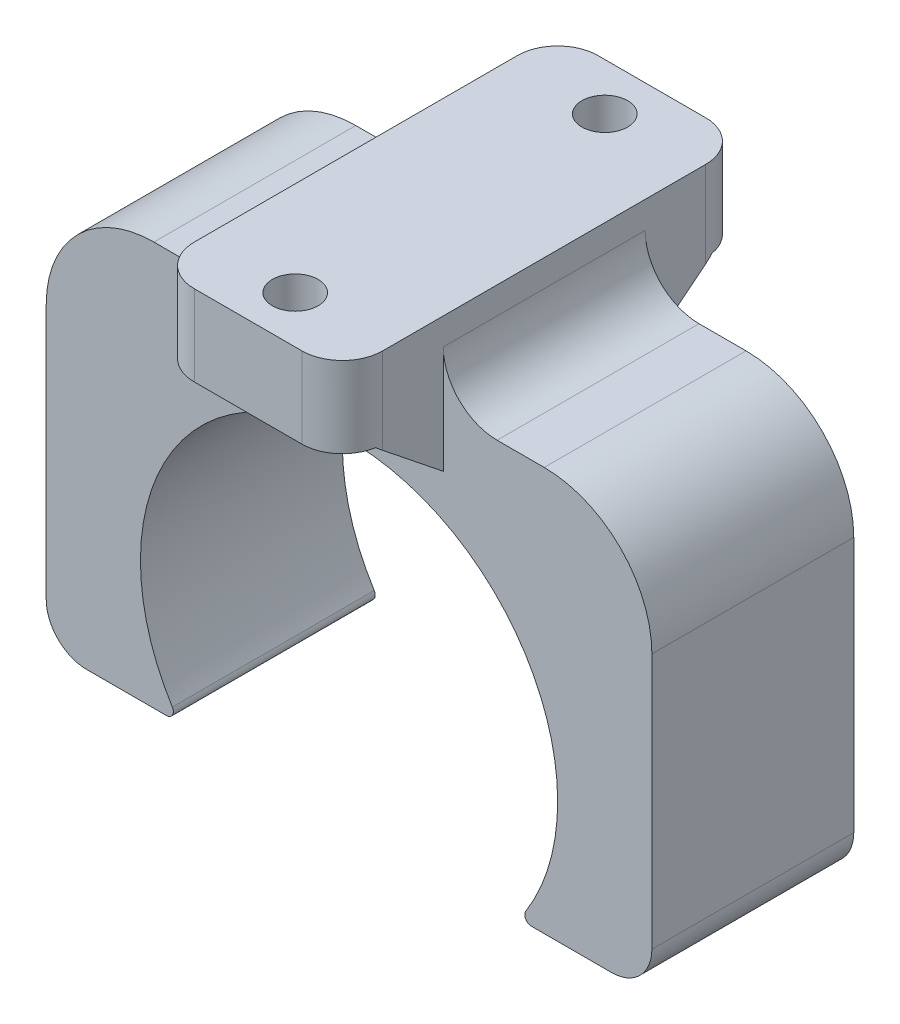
from build123d import *

# Parameters (mm, degrees)
SKETCH_1_W               = 45
SKETCH_1_H               = 30
EXTRUDE_1_DEPTH          = 7.5
SKETCH_2_R               = 15.5
CUT_EXTRUDE_1_DEPTH      = 15
FILLET_1_R               = 8
FILLET_2_R               = 3
FILLET_3_R               = 0.5
SKETCH_4_W               = 14
SKETCH_4_H               = 30
EXTRUDE_2_DEPTH          = 6
FILLET_5_R               = 4
RIB_1_REACH              = 40.448
SKETCH_5_WALL_W          = 85.299157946
SKETCH_5_WALL_H          = 2
MIRROR_2_COPY_1_REACH    = 40.448
MIRROR_2_COPY_1_SKETCH_W = 85.299157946
MIRROR_2_COPY_1_SKETCH_H = 2
SKETCH_7_R               = 1.7
CUT_EXTRUDE_2_DEPTH      = 6
FILLET_6_R               = 3


with BuildPart() as part:
    # Sketch 1 → Extrude 1 (new, symmetric)
    with BuildSketch(Plane.XY):
        Rectangle(SKETCH_1_W, SKETCH_1_H)
    extrude(amount=EXTRUDE_1_DEPTH, both=True)

    # Sketch 2 → Cut-Extrude 1 (cut)
    with BuildSketch(Plane.XY.offset(7.5)):
        with Locations((0, -6)):
            Circle(SKETCH_2_R)
    extrude(amount=-CUT_EXTRUDE_1_DEPTH, mode=Mode.SUBTRACT)

    # Fillet 1
    fillet_1_edges = [part.edges().sort_by_distance(p)[0] for p in [
        (-22.5, 15, 0),
        (22.5, 15, 0),
    ]]
    fillet(fillet_1_edges, radius=FILLET_1_R)

    # Fillet 2
    fillet_2_edges = [part.edges().sort_by_distance(p)[0] for p in [
        (22.5, -15, 0),
        (-22.5, -15, 0),
    ]]
    fillet(fillet_2_edges, radius=FILLET_2_R)

    # Fillet 3
    fillet_3_edges = [part.edges().sort_by_distance(p)[0] for p in [
        (-12.619429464, -15, 0),
        (12.619429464, -15, 0),
    ]]
    fillet(fillet_3_edges, radius=FILLET_3_R)

    # Sketch 4 → Extrude 2 (add)
    with BuildSketch(Plane(origin=(0, 15, 0), x_dir=(1, 0, 0), z_dir=(0, 1, 0))):
        Rectangle(SKETCH_4_W, SKETCH_4_H)
    extrude(amount=EXTRUDE_2_DEPTH)

    # Fillet 5
    fillet_5_edges = [part.edges().sort_by_distance(p)[0] for p in [
        (7, 15, 0),
        (-7, 15, 0),
    ]]
    fillet(fillet_5_edges, radius=FILLET_5_R)

    # Sketch 5 wall → Rib 1 (add, up to next)
    with BuildSketch(Plane(origin=(6, 13, 10), x_dir=(0, -0.624695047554, -0.780868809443), z_dir=(0, 0.780868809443, -0.624695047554)), mode=Mode.PRIVATE) as rib_1_sk1:
        Rectangle(SKETCH_5_WALL_W, SKETCH_5_WALL_H)
    rib_1_tool1 = extrude(rib_1_sk1.sketch, amount=RIB_1_REACH, mode=Mode.PRIVATE) - part.part
    rib_1 = rib_1_tool1.solids().sort_by_distance((6, 13, 10))[0]
    add(rib_1)

    # Mirror 1: Rib 1 across plane
    add(rib_1.mirror(Plane.XY))

    # Mirror 2: Rib 1 across plane
    add(rib_1.mirror(Plane(origin=(0, 0, 0), x_dir=(0, 0, 1), z_dir=(1, 0, 0))))

    # Mirror 2 copy 1 sketch → Mirror 2 copy 1 (add, up to next)
    with BuildSketch(Plane(origin=(-6, 13, -10), x_dir=(0, -0.624695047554, 0.780868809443), z_dir=(0, 0.780868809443, 0.624695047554)), mode=Mode.PRIVATE) as mirror_2_copy_1_sk1:
        Rectangle(MIRROR_2_COPY_1_SKETCH_W, MIRROR_2_COPY_1_SKETCH_H)
    mirror_2_copy_1_tool1 = extrude(mirror_2_copy_1_sk1.sketch, amount=MIRROR_2_COPY_1_REACH, mode=Mode.PRIVATE) - part.part
    add(mirror_2_copy_1_tool1.solids().sort_by_distance((-6, 13, -10))[0])

    # Sketch 7 → Cut-Extrude 2 (cut)
    with BuildSketch(Plane.XZ.offset(-15)):
        with Locations(Location((0, 11.5, 0), (0, 0, 270))):
            Circle(SKETCH_7_R)
        with Locations(Location((0, -11.5, 0), (0, 0, 270))):
            Circle(SKETCH_7_R)
    extrude(amount=-CUT_EXTRUDE_2_DEPTH, mode=Mode.SUBTRACT)

    # Fillet 6
    fillet_6_edges = [part.edges().sort_by_distance(p)[0] for p in [
        (7, 18, 15),
        (-7, 18, 15),
        (7, 18, -15),
        (-7, 18, -15),
    ]]
    fillet(fillet_6_edges, radius=FILLET_6_R)


solid = part.part
